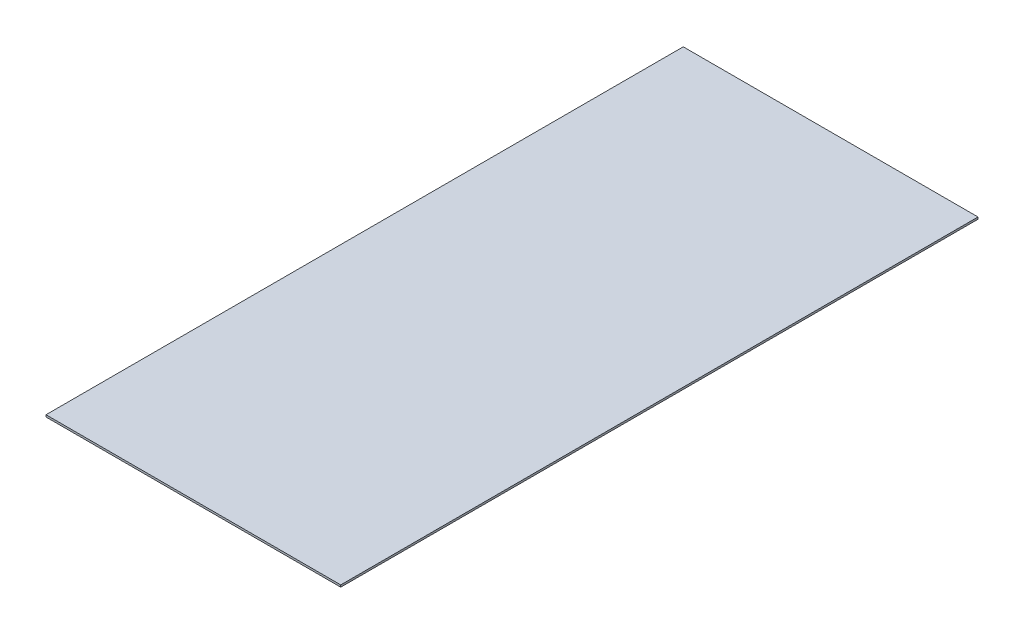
from build123d import *

# Parameters (mm, degrees)
SKETCH1_W           = 704.85
SKETCH1_H           = 1524
BOSS_EXTRUDE1_DEPTH = 4.7625


with BuildPart() as part:
    # Sketch1 → Boss-Extrude1 (new body)
    with BuildSketch(Plane(origin=(0, 0, 0), x_dir=(1, 0, 0), z_dir=(0, 1, 0))):
        Rectangle(SKETCH1_W, SKETCH1_H)
    extrude(amount=BOSS_EXTRUDE1_DEPTH)


solid = part.part
